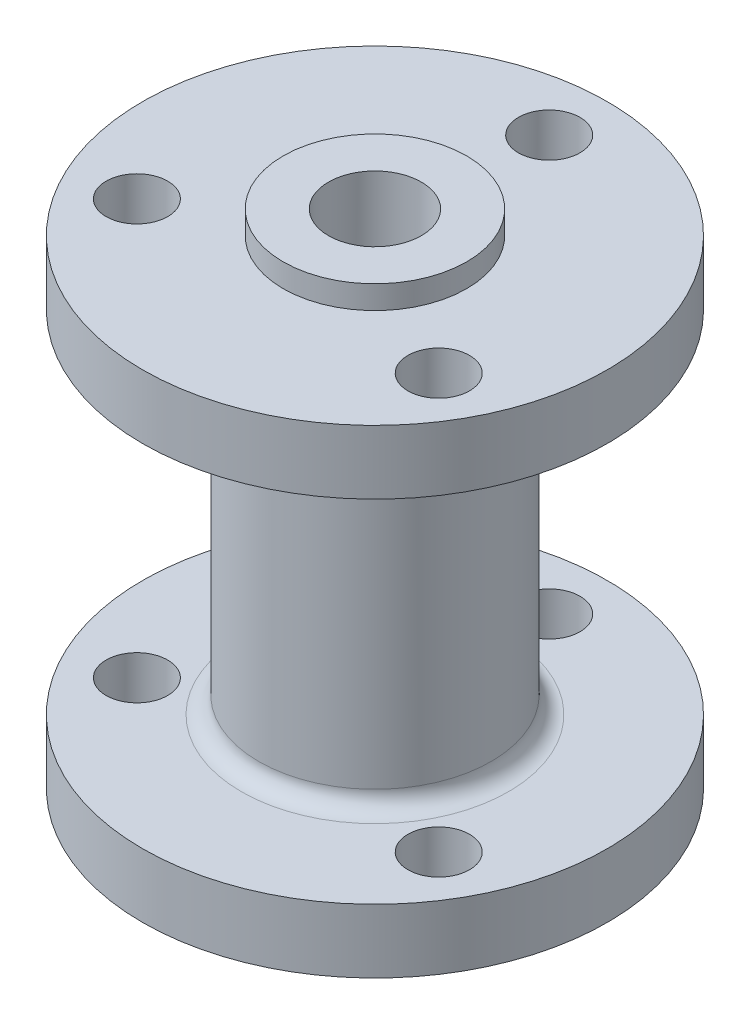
ISO-10303-21;
HEADER;
FILE_DESCRIPTION(('STEP AP214'),'2;1');
FILE_NAME('part.step','',(''),(''),'','','');
FILE_SCHEMA(('AUTOMOTIVE_DESIGN { 1 0 10303 214 1 1 1 1 }'));
ENDSEC;
DATA;
#1=APPLICATION_CONTEXT('core data for automotive mechanical design processes');
#2=APPLICATION_PROTOCOL_DEFINITION('international standard','automotive_design',2000,#1);
#3=PRODUCT_CONTEXT('',#1,'mechanical');
#4=PRODUCT('Part','Part','',(#3));
#5=PRODUCT_RELATED_PRODUCT_CATEGORY('part','',(#4));
#6=PRODUCT_DEFINITION_FORMATION('','',#4);
#7=PRODUCT_DEFINITION_CONTEXT('part definition',#1,'design');
#8=PRODUCT_DEFINITION('design','',#6,#7);
#9=PRODUCT_DEFINITION_SHAPE('','',#8);
#10=(LENGTH_UNIT() NAMED_UNIT(*) SI_UNIT(.MILLI.,.METRE.));
#11=(NAMED_UNIT(*) PLANE_ANGLE_UNIT() SI_UNIT($,.RADIAN.));
#12=(NAMED_UNIT(*) SI_UNIT($,.STERADIAN.) SOLID_ANGLE_UNIT());
#13=UNCERTAINTY_MEASURE_WITH_UNIT(LENGTH_MEASURE(1.E-05),#10,'distance_accuracy_value','');
#14=(GEOMETRIC_REPRESENTATION_CONTEXT(3) GLOBAL_UNCERTAINTY_ASSIGNED_CONTEXT((#13)) GLOBAL_UNIT_ASSIGNED_CONTEXT((#10,
#11,#12)) REPRESENTATION_CONTEXT('',''));
#15=CARTESIAN_POINT('',(0.,0.,0.));
#16=DIRECTION('',(0.,0.,1.));
#17=DIRECTION('',(1.,0.,0.));
#18=AXIS2_PLACEMENT_3D('',#15,#16,#17);
#19=CARTESIAN_POINT('',(0.,22.6,0.));
#20=DIRECTION('',(0.,1.,0.));
#21=DIRECTION('',(0.,0.,1.));
#22=AXIS2_PLACEMENT_3D('',#19,#20,#21);
#23=PLANE('',#22);
#24=CARTESIAN_POINT('',(0.,22.6,0.));
#25=DIRECTION('',(0.,1.,0.));
#26=DIRECTION('',(0.,0.,1.));
#27=AXIS2_PLACEMENT_3D('',#24,#25,#26);
#28=CIRCLE('',#27,3.99999999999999);
#29=CARTESIAN_POINT('',(0.,22.6,3.99999999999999));
#30=VERTEX_POINT('',#29);
#31=EDGE_CURVE('E131',#30,#30,#28,.T.);
#32=ORIENTED_EDGE('',*,*,#31,.F.);
#33=EDGE_LOOP('',(#32));
#34=FACE_BOUND('',#33,.T.);
#35=CARTESIAN_POINT('',(0.,22.6,0.));
#36=DIRECTION('',(0.,1.,0.));
#37=DIRECTION('',(0.,0.,1.));
#38=AXIS2_PLACEMENT_3D('',#35,#36,#37);
#39=CIRCLE('',#38,7.90000000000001);
#40=CARTESIAN_POINT('',(0.,22.6,7.90000000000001));
#41=VERTEX_POINT('',#40);
#42=EDGE_CURVE('E61',#41,#41,#39,.T.);
#43=ORIENTED_EDGE('',*,*,#42,.T.);
#44=EDGE_LOOP('',(#43));
#45=FACE_BOUND('',#44,.T.);
#46=ADVANCED_FACE('F35',(#34,#45),#23,.T.);
#47=CARTESIAN_POINT('',(0.,50.,0.));
#48=DIRECTION('',(0.,1.,0.));
#49=DIRECTION('',(0.,0.,1.));
#50=AXIS2_PLACEMENT_3D('',#47,#48,#49);
#51=CYLINDRICAL_SURFACE('',#50,7.90000000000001);
#52=CARTESIAN_POINT('',(0.,20.6,0.));
#53=DIRECTION('',(0.,1.,0.));
#54=DIRECTION('',(0.,0.,1.));
#55=AXIS2_PLACEMENT_3D('',#52,#53,#54);
#56=CIRCLE('',#55,7.90000000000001);
#57=CARTESIAN_POINT('',(0.,20.6,7.90000000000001));
#58=VERTEX_POINT('',#57);
#59=EDGE_CURVE('E89',#58,#58,#56,.T.);
#60=ORIENTED_EDGE('',*,*,#59,.T.);
#61=EDGE_LOOP('',(#60));
#62=FACE_BOUND('',#61,.T.);
#63=ORIENTED_EDGE('',*,*,#42,.F.);
#64=EDGE_LOOP('',(#63));
#65=FACE_BOUND('',#64,.T.);
#66=ADVANCED_FACE('F173',(#62,#65),#51,.T.);
#67=CARTESIAN_POINT('',(0.,20.6,7.90000000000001));
#68=DIRECTION('',(0.,1.,0.));
#69=DIRECTION('',(0.,0.,1.));
#70=AXIS2_PLACEMENT_3D('',#67,#68,#69);
#71=PLANE('',#70);
#72=CARTESIAN_POINT('',(-12.9903810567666,20.6,7.49999999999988));
#73=DIRECTION('',(0.,1.,0.));
#74=DIRECTION('',(0.,0.,1.));
#75=AXIS2_PLACEMENT_3D('',#72,#73,#74);
#76=CIRCLE('',#75,2.65);
#77=CARTESIAN_POINT('',(-12.9903810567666,20.6,10.1499999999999));
#78=VERTEX_POINT('',#77);
#79=EDGE_CURVE('E67',#78,#78,#76,.T.);
#80=ORIENTED_EDGE('',*,*,#79,.F.);
#81=EDGE_LOOP('',(#80));
#82=FACE_BOUND('',#81,.T.);
#83=CARTESIAN_POINT('',(12.9903810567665,20.6,7.50000000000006));
#84=DIRECTION('',(0.,1.,0.));
#85=DIRECTION('',(0.,0.,1.));
#86=AXIS2_PLACEMENT_3D('',#83,#84,#85);
#87=CIRCLE('',#86,2.65);
#88=CARTESIAN_POINT('',(12.9903810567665,20.6,10.1500000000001));
#89=VERTEX_POINT('',#88);
#90=EDGE_CURVE('E73',#89,#89,#87,.T.);
#91=ORIENTED_EDGE('',*,*,#90,.F.);
#92=EDGE_LOOP('',(#91));
#93=FACE_BOUND('',#92,.T.);
#94=CARTESIAN_POINT('',(0.,20.6,-15.));
#95=DIRECTION('',(0.,1.,0.));
#96=DIRECTION('',(0.,0.,1.));
#97=AXIS2_PLACEMENT_3D('',#94,#95,#96);
#98=CIRCLE('',#97,2.65);
#99=CARTESIAN_POINT('',(0.,20.6,-12.35));
#100=VERTEX_POINT('',#99);
#101=EDGE_CURVE('E79',#100,#100,#98,.T.);
#102=ORIENTED_EDGE('',*,*,#101,.F.);
#103=EDGE_LOOP('',(#102));
#104=FACE_BOUND('',#103,.T.);
#105=CARTESIAN_POINT('',(0.,20.6,0.));
#106=DIRECTION('',(0.,1.,0.));
#107=DIRECTION('',(0.,0.,1.));
#108=AXIS2_PLACEMENT_3D('',#105,#106,#107);
#109=CIRCLE('',#108,20.);
#110=CARTESIAN_POINT('',(0.,20.6,20.));
#111=VERTEX_POINT('',#110);
#112=EDGE_CURVE('E93',#111,#111,#109,.T.);
#113=ORIENTED_EDGE('',*,*,#112,.T.);
#114=EDGE_LOOP('',(#113));
#115=FACE_BOUND('',#114,.T.);
#116=ORIENTED_EDGE('',*,*,#59,.F.);
#117=EDGE_LOOP('',(#116));
#118=FACE_BOUND('',#117,.T.);
#119=ADVANCED_FACE('F169',(#82,#93,#104,#115,#118),#71,.T.);
#120=CARTESIAN_POINT('',(0.,50.,0.));
#121=DIRECTION('',(0.,1.,0.));
#122=DIRECTION('',(0.,0.,1.));
#123=AXIS2_PLACEMENT_3D('',#120,#121,#122);
#124=CYLINDRICAL_SURFACE('',#123,20.);
#125=CARTESIAN_POINT('',(0.,15.1,0.));
#126=DIRECTION('',(0.,1.,0.));
#127=DIRECTION('',(0.,0.,1.));
#128=AXIS2_PLACEMENT_3D('',#125,#126,#127);
#129=CIRCLE('',#128,20.);
#130=CARTESIAN_POINT('',(0.,15.1,20.));
#131=VERTEX_POINT('',#130);
#132=EDGE_CURVE('E97',#131,#131,#129,.T.);
#133=ORIENTED_EDGE('',*,*,#132,.T.);
#134=EDGE_LOOP('',(#133));
#135=FACE_BOUND('',#134,.T.);
#136=ORIENTED_EDGE('',*,*,#112,.F.);
#137=EDGE_LOOP('',(#136));
#138=FACE_BOUND('',#137,.T.);
#139=ADVANCED_FACE('F172',(#135,#138),#124,.T.);
#140=CARTESIAN_POINT('',(0.,15.1,20.));
#141=DIRECTION('',(0.,-1.,0.));
#142=DIRECTION('',(0.,0.,-1.));
#143=AXIS2_PLACEMENT_3D('',#140,#141,#142);
#144=PLANE('',#143);
#145=CARTESIAN_POINT('',(0.,15.1,0.));
#146=DIRECTION('',(0.,-1.,0.));
#147=DIRECTION('',(0.,0.,-1.));
#148=AXIS2_PLACEMENT_3D('',#145,#146,#147);
#149=CIRCLE('',#148,11.5);
#150=CARTESIAN_POINT('',(0.,15.1,-11.5));
#151=VERTEX_POINT('',#150);
#152=EDGE_CURVE('E10',#151,#151,#149,.F.);
#153=ORIENTED_EDGE('',*,*,#152,.T.);
#154=EDGE_LOOP('',(#153));
#155=FACE_BOUND('',#154,.T.);
#156=CARTESIAN_POINT('',(-12.9903810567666,15.1,7.49999999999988));
#157=DIRECTION('',(0.,-1.,0.));
#158=DIRECTION('',(0.,0.,-1.));
#159=AXIS2_PLACEMENT_3D('',#156,#157,#158);
#160=CIRCLE('',#159,2.64999999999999);
#161=CARTESIAN_POINT('',(-12.9903810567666,15.1,4.84999999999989));
#162=VERTEX_POINT('',#161);
#163=EDGE_CURVE('E66',#162,#162,#160,.T.);
#164=ORIENTED_EDGE('',*,*,#163,.F.);
#165=EDGE_LOOP('',(#164));
#166=FACE_BOUND('',#165,.T.);
#167=CARTESIAN_POINT('',(12.9903810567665,15.1,7.50000000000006));
#168=DIRECTION('',(0.,-1.,0.));
#169=DIRECTION('',(0.,0.,-1.));
#170=AXIS2_PLACEMENT_3D('',#167,#168,#169);
#171=CIRCLE('',#170,2.64999999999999);
#172=CARTESIAN_POINT('',(12.9903810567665,15.1,4.85000000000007));
#173=VERTEX_POINT('',#172);
#174=EDGE_CURVE('E72',#173,#173,#171,.T.);
#175=ORIENTED_EDGE('',*,*,#174,.F.);
#176=EDGE_LOOP('',(#175));
#177=FACE_BOUND('',#176,.T.);
#178=CARTESIAN_POINT('',(0.,15.1,-15.));
#179=DIRECTION('',(0.,-1.,0.));
#180=DIRECTION('',(0.,0.,-1.));
#181=AXIS2_PLACEMENT_3D('',#178,#179,#180);
#182=CIRCLE('',#181,2.64999999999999);
#183=CARTESIAN_POINT('',(0.,15.1,-17.65));
#184=VERTEX_POINT('',#183);
#185=EDGE_CURVE('E78',#184,#184,#182,.T.);
#186=ORIENTED_EDGE('',*,*,#185,.F.);
#187=EDGE_LOOP('',(#186));
#188=FACE_BOUND('',#187,.T.);
#189=ORIENTED_EDGE('',*,*,#132,.F.);
#190=EDGE_LOOP('',(#189));
#191=FACE_BOUND('',#190,.T.);
#192=ADVANCED_FACE('F212',(#155,#166,#177,#188,#191),#144,.T.);
#193=CARTESIAN_POINT('',(0.,50.,0.));
#194=DIRECTION('',(0.,1.,0.));
#195=DIRECTION('',(0.,0.,1.));
#196=AXIS2_PLACEMENT_3D('',#193,#194,#195);
#197=CYLINDRICAL_SURFACE('',#196,10.);
#198=CARTESIAN_POINT('',(0.,-13.6,0.));
#199=DIRECTION('',(0.,1.,0.));
#200=DIRECTION('',(0.,0.,1.));
#201=AXIS2_PLACEMENT_3D('',#198,#199,#200);
#202=CIRCLE('',#201,10.);
#203=CARTESIAN_POINT('',(0.,-13.6,10.));
#204=VERTEX_POINT('',#203);
#205=EDGE_CURVE('E49',#204,#204,#202,.T.);
#206=ORIENTED_EDGE('',*,*,#205,.T.);
#207=EDGE_LOOP('',(#206));
#208=FACE_BOUND('',#207,.T.);
#209=CARTESIAN_POINT('',(0.,13.6,0.));
#210=DIRECTION('',(0.,-1.,0.));
#211=DIRECTION('',(0.,0.,-1.));
#212=AXIS2_PLACEMENT_3D('',#209,#210,#211);
#213=CIRCLE('',#212,10.);
#214=CARTESIAN_POINT('',(0.,13.6,-10.));
#215=VERTEX_POINT('',#214);
#216=EDGE_CURVE('E55',#215,#215,#213,.T.);
#217=ORIENTED_EDGE('',*,*,#216,.T.);
#218=EDGE_LOOP('',(#217));
#219=FACE_BOUND('',#218,.T.);
#220=ADVANCED_FACE('F208',(#208,#219),#197,.T.);
#221=CARTESIAN_POINT('',(0.,-15.1,10.));
#222=DIRECTION('',(0.,1.,0.));
#223=DIRECTION('',(0.,0.,1.));
#224=AXIS2_PLACEMENT_3D('',#221,#222,#223);
#225=PLANE('',#224);
#226=CARTESIAN_POINT('',(0.,-15.1,0.));
#227=DIRECTION('',(0.,1.,0.));
#228=DIRECTION('',(0.,0.,1.));
#229=AXIS2_PLACEMENT_3D('',#226,#227,#228);
#230=CIRCLE('',#229,11.5);
#231=CARTESIAN_POINT('',(0.,-15.1,11.5));
#232=VERTEX_POINT('',#231);
#233=EDGE_CURVE('E43',#232,#232,#230,.F.);
#234=ORIENTED_EDGE('',*,*,#233,.T.);
#235=EDGE_LOOP('',(#234));
#236=FACE_BOUND('',#235,.T.);
#237=CARTESIAN_POINT('',(-12.9903810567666,-15.1,7.49999999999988));
#238=DIRECTION('',(0.,1.,0.));
#239=DIRECTION('',(0.,0.,1.));
#240=AXIS2_PLACEMENT_3D('',#237,#238,#239);
#241=CIRCLE('',#240,2.64999999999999);
#242=CARTESIAN_POINT('',(-12.9903810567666,-15.1,10.1499999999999));
#243=VERTEX_POINT('',#242);
#244=EDGE_CURVE('E155',#243,#243,#241,.T.);
#245=ORIENTED_EDGE('',*,*,#244,.F.);
#246=EDGE_LOOP('',(#245));
#247=FACE_BOUND('',#246,.T.);
#248=CARTESIAN_POINT('',(12.9903810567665,-15.1,7.50000000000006));
#249=DIRECTION('',(0.,1.,0.));
#250=DIRECTION('',(0.,0.,1.));
#251=AXIS2_PLACEMENT_3D('',#248,#249,#250);
#252=CIRCLE('',#251,2.64999999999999);
#253=CARTESIAN_POINT('',(12.9903810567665,-15.1,10.1500000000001));
#254=VERTEX_POINT('',#253);
#255=EDGE_CURVE('E145',#254,#254,#252,.T.);
#256=ORIENTED_EDGE('',*,*,#255,.F.);
#257=EDGE_LOOP('',(#256));
#258=FACE_BOUND('',#257,.T.);
#259=CARTESIAN_POINT('',(0.,-15.1,-15.));
#260=DIRECTION('',(0.,1.,0.));
#261=DIRECTION('',(0.,0.,1.));
#262=AXIS2_PLACEMENT_3D('',#259,#260,#261);
#263=CIRCLE('',#262,2.64999999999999);
#264=CARTESIAN_POINT('',(0.,-15.1,-12.35));
#265=VERTEX_POINT('',#264);
#266=EDGE_CURVE('E135',#265,#265,#263,.T.);
#267=ORIENTED_EDGE('',*,*,#266,.F.);
#268=EDGE_LOOP('',(#267));
#269=FACE_BOUND('',#268,.T.);
#270=CARTESIAN_POINT('',(0.,-15.1,0.));
#271=DIRECTION('',(0.,1.,0.));
#272=DIRECTION('',(0.,0.,1.));
#273=AXIS2_PLACEMENT_3D('',#270,#271,#272);
#274=CIRCLE('',#273,20.);
#275=CARTESIAN_POINT('',(0.,-15.1,20.));
#276=VERTEX_POINT('',#275);
#277=EDGE_CURVE('E101',#276,#276,#274,.T.);
#278=ORIENTED_EDGE('',*,*,#277,.T.);
#279=EDGE_LOOP('',(#278));
#280=FACE_BOUND('',#279,.T.);
#281=ADVANCED_FACE('F211',(#236,#247,#258,#269,#280),#225,.T.);
#282=CARTESIAN_POINT('',(0.,50.,0.));
#283=DIRECTION('',(0.,1.,0.));
#284=DIRECTION('',(0.,0.,1.));
#285=AXIS2_PLACEMENT_3D('',#282,#283,#284);
#286=CYLINDRICAL_SURFACE('',#285,20.);
#287=CARTESIAN_POINT('',(0.,-20.6,0.));
#288=DIRECTION('',(0.,1.,0.));
#289=DIRECTION('',(0.,0.,1.));
#290=AXIS2_PLACEMENT_3D('',#287,#288,#289);
#291=CIRCLE('',#290,20.);
#292=CARTESIAN_POINT('',(0.,-20.6,20.));
#293=VERTEX_POINT('',#292);
#294=EDGE_CURVE('E105',#293,#293,#291,.T.);
#295=ORIENTED_EDGE('',*,*,#294,.T.);
#296=EDGE_LOOP('',(#295));
#297=FACE_BOUND('',#296,.T.);
#298=ORIENTED_EDGE('',*,*,#277,.F.);
#299=EDGE_LOOP('',(#298));
#300=FACE_BOUND('',#299,.T.);
#301=ADVANCED_FACE('F220',(#297,#300),#286,.T.);
#302=CARTESIAN_POINT('',(0.,-20.6,20.));
#303=DIRECTION('',(0.,-1.,0.));
#304=DIRECTION('',(0.,0.,-1.));
#305=AXIS2_PLACEMENT_3D('',#302,#303,#304);
#306=PLANE('',#305);
#307=CARTESIAN_POINT('',(-12.9903810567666,-20.6,7.49999999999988));
#308=DIRECTION('',(0.,-1.,0.));
#309=DIRECTION('',(0.,0.,-1.));
#310=AXIS2_PLACEMENT_3D('',#307,#308,#309);
#311=CIRCLE('',#310,2.64999999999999);
#312=CARTESIAN_POINT('',(-12.9903810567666,-20.6,4.84999999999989));
#313=VERTEX_POINT('',#312);
#314=EDGE_CURVE('E62',#313,#313,#311,.T.);
#315=ORIENTED_EDGE('',*,*,#314,.F.);
#316=EDGE_LOOP('',(#315));
#317=FACE_BOUND('',#316,.T.);
#318=CARTESIAN_POINT('',(12.9903810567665,-20.6,7.50000000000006));
#319=DIRECTION('',(0.,-1.,0.));
#320=DIRECTION('',(0.,0.,-1.));
#321=AXIS2_PLACEMENT_3D('',#318,#319,#320);
#322=CIRCLE('',#321,2.64999999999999);
#323=CARTESIAN_POINT('',(12.9903810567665,-20.6,4.85000000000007));
#324=VERTEX_POINT('',#323);
#325=EDGE_CURVE('E68',#324,#324,#322,.T.);
#326=ORIENTED_EDGE('',*,*,#325,.F.);
#327=EDGE_LOOP('',(#326));
#328=FACE_BOUND('',#327,.T.);
#329=CARTESIAN_POINT('',(0.,-20.6,-15.));
#330=DIRECTION('',(0.,-1.,0.));
#331=DIRECTION('',(0.,0.,-1.));
#332=AXIS2_PLACEMENT_3D('',#329,#330,#331);
#333=CIRCLE('',#332,2.64999999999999);
#334=CARTESIAN_POINT('',(0.,-20.6,-17.65));
#335=VERTEX_POINT('',#334);
#336=EDGE_CURVE('E74',#335,#335,#333,.T.);
#337=ORIENTED_EDGE('',*,*,#336,.F.);
#338=EDGE_LOOP('',(#337));
#339=FACE_BOUND('',#338,.T.);
#340=CARTESIAN_POINT('',(0.,-20.6,0.));
#341=DIRECTION('',(0.,1.,0.));
#342=DIRECTION('',(0.,0.,1.));
#343=AXIS2_PLACEMENT_3D('',#340,#341,#342);
#344=CIRCLE('',#343,7.9);
#345=CARTESIAN_POINT('',(0.,-20.6,7.9));
#346=VERTEX_POINT('',#345);
#347=EDGE_CURVE('E109',#346,#346,#344,.T.);
#348=ORIENTED_EDGE('',*,*,#347,.T.);
#349=EDGE_LOOP('',(#348));
#350=FACE_BOUND('',#349,.T.);
#351=ORIENTED_EDGE('',*,*,#294,.F.);
#352=EDGE_LOOP('',(#351));
#353=FACE_BOUND('',#352,.T.);
#354=ADVANCED_FACE('F259',(#317,#328,#339,#350,#353),#306,.T.);
#355=CARTESIAN_POINT('',(0.,50.,0.));
#356=DIRECTION('',(0.,1.,0.));
#357=DIRECTION('',(0.,0.,1.));
#358=AXIS2_PLACEMENT_3D('',#355,#356,#357);
#359=CYLINDRICAL_SURFACE('',#358,7.9);
#360=CARTESIAN_POINT('',(0.,-22.6,0.));
#361=DIRECTION('',(0.,1.,0.));
#362=DIRECTION('',(0.,0.,1.));
#363=AXIS2_PLACEMENT_3D('',#360,#361,#362);
#364=CIRCLE('',#363,7.9);
#365=CARTESIAN_POINT('',(0.,-22.6,7.9));
#366=VERTEX_POINT('',#365);
#367=EDGE_CURVE('E113',#366,#366,#364,.T.);
#368=ORIENTED_EDGE('',*,*,#367,.T.);
#369=EDGE_LOOP('',(#368));
#370=FACE_BOUND('',#369,.T.);
#371=ORIENTED_EDGE('',*,*,#347,.F.);
#372=EDGE_LOOP('',(#371));
#373=FACE_BOUND('',#372,.T.);
#374=ADVANCED_FACE('F269',(#370,#373),#359,.T.);
#375=CARTESIAN_POINT('',(0.,-22.6,7.9));
#376=DIRECTION('',(0.,-1.,0.));
#377=DIRECTION('',(0.,0.,-1.));
#378=AXIS2_PLACEMENT_3D('',#375,#376,#377);
#379=PLANE('',#378);
#380=CARTESIAN_POINT('',(0.,-22.6,0.));
#381=DIRECTION('',(0.,1.,0.));
#382=DIRECTION('',(0.,0.,1.));
#383=AXIS2_PLACEMENT_3D('',#380,#381,#382);
#384=CIRCLE('',#383,3.99999999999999);
#385=CARTESIAN_POINT('',(0.,-22.6,3.99999999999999));
#386=VERTEX_POINT('',#385);
#387=EDGE_CURVE('E85',#386,#386,#384,.T.);
#388=ORIENTED_EDGE('',*,*,#387,.T.);
#389=EDGE_LOOP('',(#388));
#390=FACE_BOUND('',#389,.T.);
#391=ORIENTED_EDGE('',*,*,#367,.F.);
#392=EDGE_LOOP('',(#391));
#393=FACE_BOUND('',#392,.T.);
#394=ADVANCED_FACE('F280',(#390,#393),#379,.T.);
#395=CARTESIAN_POINT('',(0.,22.6,0.));
#396=DIRECTION('',(0.,1.,0.));
#397=DIRECTION('',(0.,0.,1.));
#398=AXIS2_PLACEMENT_3D('',#395,#396,#397);
#399=CYLINDRICAL_SURFACE('',#398,3.99999999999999);
#400=CARTESIAN_POINT('',(0.,-15.1,0.));
#401=DIRECTION('',(0.,1.,0.));
#402=DIRECTION('',(0.,0.,1.));
#403=AXIS2_PLACEMENT_3D('',#400,#401,#402);
#404=CIRCLE('',#403,3.99999999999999);
#405=CARTESIAN_POINT('',(0.,-15.1,3.99999999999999));
#406=VERTEX_POINT('',#405);
#407=EDGE_CURVE('E80',#406,#406,#404,.T.);
#408=ORIENTED_EDGE('',*,*,#407,.T.);
#409=EDGE_LOOP('',(#408));
#410=FACE_BOUND('',#409,.T.);
#411=ORIENTED_EDGE('',*,*,#387,.F.);
#412=EDGE_LOOP('',(#411));
#413=FACE_BOUND('',#412,.T.);
#414=ADVANCED_FACE('F291',(#410,#413),#399,.F.);
#415=CARTESIAN_POINT('',(0.,15.1,0.));
#416=DIRECTION('',(0.,-1.,0.));
#417=DIRECTION('',(0.,0.,-1.));
#418=AXIS2_PLACEMENT_3D('',#415,#416,#417);
#419=CIRCLE('',#418,3.99999999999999);
#420=CARTESIAN_POINT('',(0.,15.1,-3.99999999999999));
#421=VERTEX_POINT('',#420);
#422=EDGE_CURVE('E84',#421,#421,#419,.T.);
#423=ORIENTED_EDGE('',*,*,#422,.T.);
#424=EDGE_LOOP('',(#423));
#425=FACE_BOUND('',#424,.T.);
#426=ORIENTED_EDGE('',*,*,#31,.T.);
#427=EDGE_LOOP('',(#426));
#428=FACE_BOUND('',#427,.T.);
#429=ADVANCED_FACE('F326',(#425,#428),#399,.F.);
#430=CARTESIAN_POINT('',(0.,-15.1,0.));
#431=DIRECTION('',(0.,1.,0.));
#432=DIRECTION('',(0.,0.,1.));
#433=AXIS2_PLACEMENT_3D('',#430,#431,#432);
#434=PLANE('',#433);
#435=ORIENTED_EDGE('',*,*,#407,.F.);
#436=EDGE_LOOP('',(#435));
#437=FACE_BOUND('',#436,.T.);
#438=CARTESIAN_POINT('',(0.,-15.1,0.));
#439=DIRECTION('',(0.,1.,0.));
#440=DIRECTION('',(0.,0.,1.));
#441=AXIS2_PLACEMENT_3D('',#438,#439,#440);
#442=CIRCLE('',#441,6.5);
#443=CARTESIAN_POINT('',(0.,-15.1,6.5));
#444=VERTEX_POINT('',#443);
#445=EDGE_CURVE('E117',#444,#444,#442,.T.);
#446=ORIENTED_EDGE('',*,*,#445,.T.);
#447=EDGE_LOOP('',(#446));
#448=FACE_BOUND('',#447,.T.);
#449=ADVANCED_FACE('F318',(#437,#448),#434,.T.);
#450=CARTESIAN_POINT('',(0.,50.,0.));
#451=DIRECTION('',(0.,1.,0.));
#452=DIRECTION('',(0.,0.,1.));
#453=AXIS2_PLACEMENT_3D('',#450,#451,#452);
#454=CYLINDRICAL_SURFACE('',#453,6.5);
#455=CARTESIAN_POINT('',(0.,15.1,0.));
#456=DIRECTION('',(0.,1.,0.));
#457=DIRECTION('',(0.,0.,1.));
#458=AXIS2_PLACEMENT_3D('',#455,#456,#457);
#459=CIRCLE('',#458,6.5);
#460=CARTESIAN_POINT('',(0.,15.1,6.5));
#461=VERTEX_POINT('',#460);
#462=EDGE_CURVE('E121',#461,#461,#459,.T.);
#463=ORIENTED_EDGE('',*,*,#462,.T.);
#464=EDGE_LOOP('',(#463));
#465=FACE_BOUND('',#464,.T.);
#466=ORIENTED_EDGE('',*,*,#445,.F.);
#467=EDGE_LOOP('',(#466));
#468=FACE_BOUND('',#467,.T.);
#469=ADVANCED_FACE('F306',(#465,#468),#454,.F.);
#470=CARTESIAN_POINT('',(0.,15.1,6.5));
#471=DIRECTION('',(0.,-1.,0.));
#472=DIRECTION('',(0.,0.,-1.));
#473=AXIS2_PLACEMENT_3D('',#470,#471,#472);
#474=PLANE('',#473);
#475=ORIENTED_EDGE('',*,*,#422,.F.);
#476=EDGE_LOOP('',(#475));
#477=FACE_BOUND('',#476,.T.);
#478=ORIENTED_EDGE('',*,*,#462,.F.);
#479=EDGE_LOOP('',(#478));
#480=FACE_BOUND('',#479,.T.);
#481=ADVANCED_FACE('F300',(#477,#480),#474,.T.);
#482=CARTESIAN_POINT('',(0.,20.6,-15.));
#483=DIRECTION('',(0.,1.,0.));
#484=DIRECTION('',(0.,0.,1.));
#485=AXIS2_PLACEMENT_3D('',#482,#483,#484);
#486=CYLINDRICAL_SURFACE('',#485,2.64999999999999);
#487=ORIENTED_EDGE('',*,*,#266,.T.);
#488=EDGE_LOOP('',(#487));
#489=FACE_BOUND('',#488,.T.);
#490=ORIENTED_EDGE('',*,*,#336,.T.);
#491=EDGE_LOOP('',(#490));
#492=FACE_BOUND('',#491,.T.);
#493=ADVANCED_FACE('F305',(#489,#492),#486,.F.);
#494=ORIENTED_EDGE('',*,*,#185,.T.);
#495=EDGE_LOOP('',(#494));
#496=FACE_BOUND('',#495,.T.);
#497=ORIENTED_EDGE('',*,*,#101,.T.);
#498=EDGE_LOOP('',(#497));
#499=FACE_BOUND('',#498,.T.);
#500=ADVANCED_FACE('F357',(#496,#499),#486,.F.);
#501=CARTESIAN_POINT('',(12.9903810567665,20.6,7.50000000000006));
#502=DIRECTION('',(0.,1.,0.));
#503=DIRECTION('',(0.,0.,1.));
#504=AXIS2_PLACEMENT_3D('',#501,#502,#503);
#505=CYLINDRICAL_SURFACE('',#504,2.64999999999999);
#506=ORIENTED_EDGE('',*,*,#255,.T.);
#507=EDGE_LOOP('',(#506));
#508=FACE_BOUND('',#507,.T.);
#509=ORIENTED_EDGE('',*,*,#325,.T.);
#510=EDGE_LOOP('',(#509));
#511=FACE_BOUND('',#510,.T.);
#512=ADVANCED_FACE('F362',(#508,#511),#505,.F.);
#513=ORIENTED_EDGE('',*,*,#174,.T.);
#514=EDGE_LOOP('',(#513));
#515=FACE_BOUND('',#514,.T.);
#516=ORIENTED_EDGE('',*,*,#90,.T.);
#517=EDGE_LOOP('',(#516));
#518=FACE_BOUND('',#517,.T.);
#519=ADVANCED_FACE('F369',(#515,#518),#505,.F.);
#520=CARTESIAN_POINT('',(-12.9903810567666,20.6,7.49999999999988));
#521=DIRECTION('',(0.,1.,0.));
#522=DIRECTION('',(0.,0.,1.));
#523=AXIS2_PLACEMENT_3D('',#520,#521,#522);
#524=CYLINDRICAL_SURFACE('',#523,2.64999999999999);
#525=ORIENTED_EDGE('',*,*,#244,.T.);
#526=EDGE_LOOP('',(#525));
#527=FACE_BOUND('',#526,.T.);
#528=ORIENTED_EDGE('',*,*,#314,.T.);
#529=EDGE_LOOP('',(#528));
#530=FACE_BOUND('',#529,.T.);
#531=ADVANCED_FACE('F202',(#527,#530),#524,.F.);
#532=ORIENTED_EDGE('',*,*,#163,.T.);
#533=EDGE_LOOP('',(#532));
#534=FACE_BOUND('',#533,.T.);
#535=ORIENTED_EDGE('',*,*,#79,.T.);
#536=EDGE_LOOP('',(#535));
#537=FACE_BOUND('',#536,.T.);
#538=ADVANCED_FACE('F167',(#534,#537),#524,.F.);
#539=CARTESIAN_POINT('',(0.,-13.6,0.));
#540=DIRECTION('',(0.,1.,0.));
#541=DIRECTION('',(0.,0.,1.));
#542=AXIS2_PLACEMENT_3D('',#539,#540,#541);
#543=TOROIDAL_SURFACE('',#542,11.5,1.5);
#544=ORIENTED_EDGE('',*,*,#233,.F.);
#545=EDGE_LOOP('',(#544));
#546=FACE_BOUND('',#545,.T.);
#547=ORIENTED_EDGE('',*,*,#205,.F.);
#548=EDGE_LOOP('',(#547));
#549=FACE_BOUND('',#548,.T.);
#550=ADVANCED_FACE('F194',(#546,#549),#543,.F.);
#551=CARTESIAN_POINT('',(0.,13.6,0.));
#552=DIRECTION('',(0.,-1.,0.));
#553=DIRECTION('',(0.,0.,-1.));
#554=AXIS2_PLACEMENT_3D('',#551,#552,#553);
#555=TOROIDAL_SURFACE('',#554,11.5,1.5);
#556=ORIENTED_EDGE('',*,*,#216,.F.);
#557=EDGE_LOOP('',(#556));
#558=FACE_BOUND('',#557,.T.);
#559=ORIENTED_EDGE('',*,*,#152,.F.);
#560=EDGE_LOOP('',(#559));
#561=FACE_BOUND('',#560,.T.);
#562=ADVANCED_FACE('F37',(#558,#561),#555,.F.);
#563=CLOSED_SHELL('',(#46,#66,#119,#139,#192,#220,#281,#301,#354,#374,#394,#414,#429,#449,#469,
#481,#493,#500,#512,#519,#531,#538,#550,#562));
#564=MANIFOLD_SOLID_BREP('B2',#563);
#565=ADVANCED_BREP_SHAPE_REPRESENTATION('',(#18,#564),#14);
#566=SHAPE_DEFINITION_REPRESENTATION(#9,#565);
ENDSEC;
END-ISO-10303-21;
